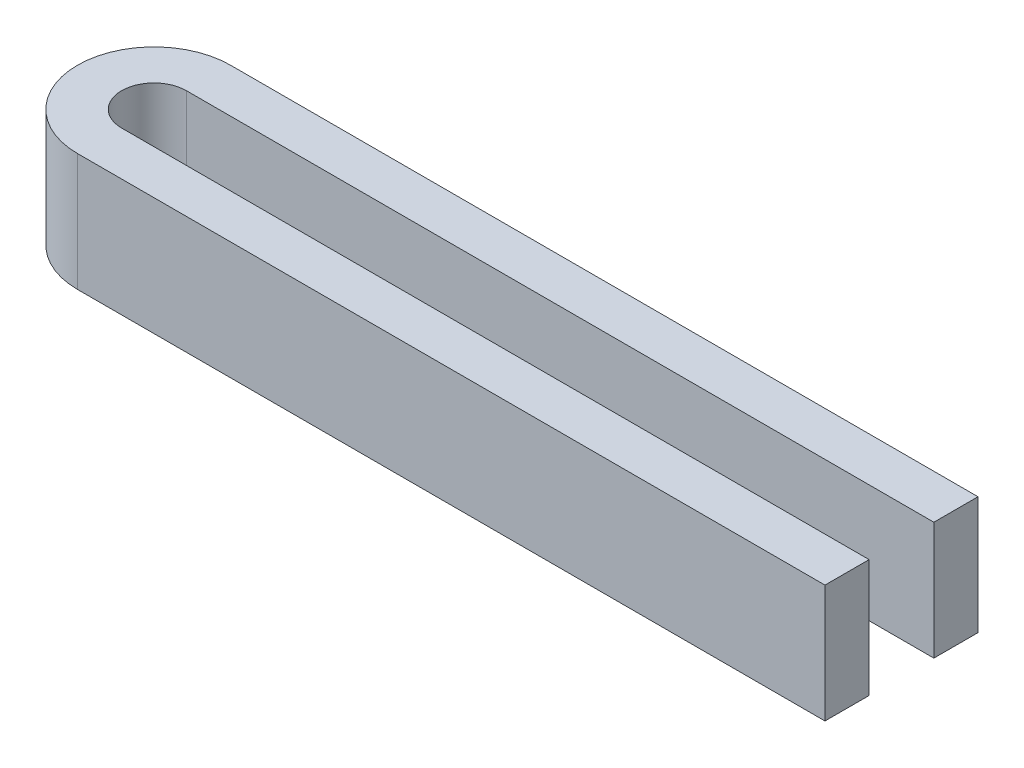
from build123d import *

# Parameters (mm, degrees)
BOSS_EXTRU_1_DEPTH = 40


with BuildPart() as part:
    # Esquisse1 → Boss.-Extru.1 (new body)
    with BuildSketch(Plane(origin=(0, 0, 0), x_dir=(1, 0, 0), z_dir=(0, 1, 0))):
        with BuildLine():
            Line((0, 26), (254, 26))
            Line((254, 26), (254, 11))
            Line((254, 11), (0, 11))
            ThreePointArc((0, 11), (-11, 0), (0, -11))
            Line((0, -11), (254, -11))
            Line((254, -11), (254, -26))
            Line((254, -26), (0, -26))
            ThreePointArc((0, -26), (-26, 0), (0, 26))
        make_face()
    extrude(amount=BOSS_EXTRU_1_DEPTH)


solid = part.part
